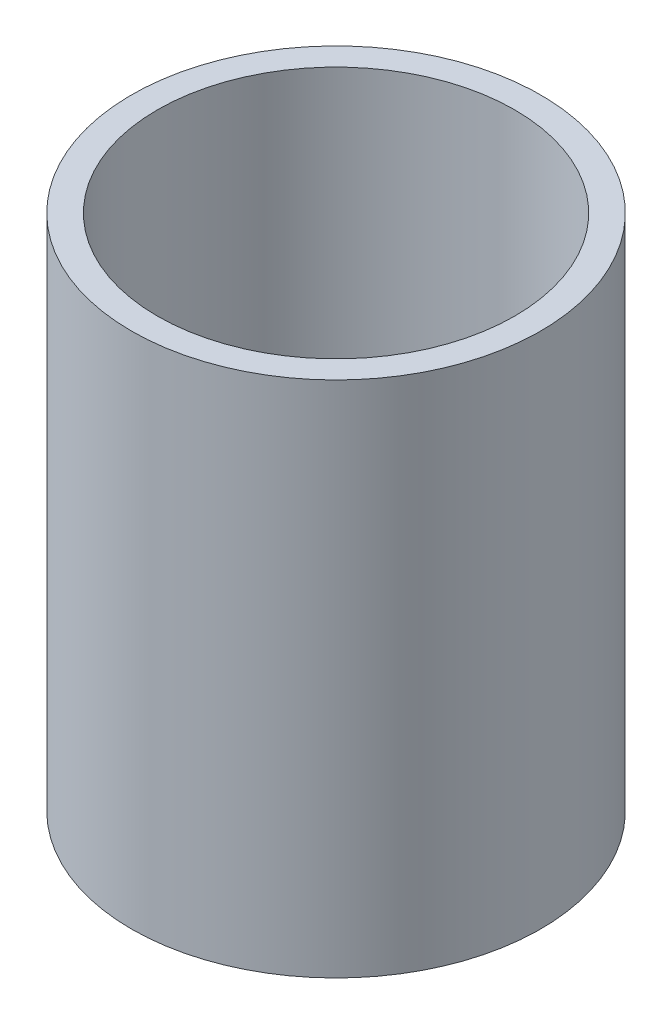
from build123d import *

# Parameters (mm, degrees)
SKETCH1_R           = 10.033
SKETCH1_R_2         = 8.763
BOSS_EXTRUDE1_DEPTH = 25.4


with BuildPart() as part:
    # Sketch1 → Boss-Extrude1 (new body)
    with BuildSketch(Plane(origin=(0, 0, 0), x_dir=(1, 0, 0), z_dir=(0, 1, 0))):
        with Locations(Location((0, 0, 0), (0, 0, 270))):
            Circle(SKETCH1_R)
        with Locations(Location((0, 0, 0), (0, 0, 270))):
            Circle(SKETCH1_R_2, mode=Mode.SUBTRACT)
    extrude(amount=BOSS_EXTRUDE1_DEPTH)


solid = part.part
